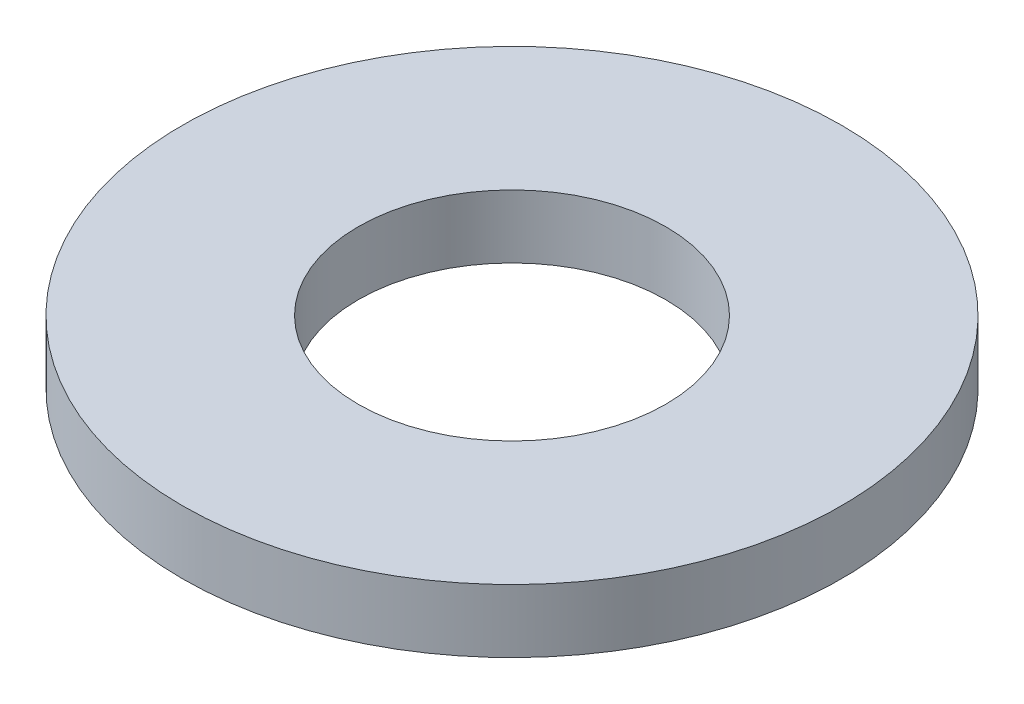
ISO-10303-21;
HEADER;
FILE_DESCRIPTION(('STEP AP214'),'2;1');
FILE_NAME('part.step','',(''),(''),'','','');
FILE_SCHEMA(('AUTOMOTIVE_DESIGN { 1 0 10303 214 1 1 1 1 }'));
ENDSEC;
DATA;
#1=APPLICATION_CONTEXT('core data for automotive mechanical design processes');
#2=APPLICATION_PROTOCOL_DEFINITION('international standard','automotive_design',2000,#1);
#3=PRODUCT_CONTEXT('',#1,'mechanical');
#4=PRODUCT('Part','Part','',(#3));
#5=PRODUCT_RELATED_PRODUCT_CATEGORY('part','',(#4));
#6=PRODUCT_DEFINITION_FORMATION('','',#4);
#7=PRODUCT_DEFINITION_CONTEXT('part definition',#1,'design');
#8=PRODUCT_DEFINITION('design','',#6,#7);
#9=PRODUCT_DEFINITION_SHAPE('','',#8);
#10=(LENGTH_UNIT() NAMED_UNIT(*) SI_UNIT(.MILLI.,.METRE.));
#11=(NAMED_UNIT(*) PLANE_ANGLE_UNIT() SI_UNIT($,.RADIAN.));
#12=(NAMED_UNIT(*) SI_UNIT($,.STERADIAN.) SOLID_ANGLE_UNIT());
#13=UNCERTAINTY_MEASURE_WITH_UNIT(LENGTH_MEASURE(1.E-05),#10,'distance_accuracy_value','');
#14=(GEOMETRIC_REPRESENTATION_CONTEXT(3) GLOBAL_UNCERTAINTY_ASSIGNED_CONTEXT((#13)) GLOBAL_UNIT_ASSIGNED_CONTEXT((#10,
#11,#12)) REPRESENTATION_CONTEXT('',''));
#15=CARTESIAN_POINT('',(0.,0.,0.));
#16=DIRECTION('',(0.,0.,1.));
#17=DIRECTION('',(1.,0.,0.));
#18=AXIS2_PLACEMENT_3D('',#15,#16,#17);
#19=CARTESIAN_POINT('',(0.,0.9144,0.));
#20=DIRECTION('',(0.,-1.,0.));
#21=DIRECTION('',(0.,0.,-1.));
#22=AXIS2_PLACEMENT_3D('',#19,#20,#21);
#23=CYLINDRICAL_SURFACE('',#22,4.7625);
#24=CARTESIAN_POINT('',(0.,0.9144,0.));
#25=DIRECTION('',(0.,1.,0.));
#26=DIRECTION('',(0.,0.,1.));
#27=AXIS2_PLACEMENT_3D('',#24,#25,#26);
#28=CIRCLE('',#27,4.7625);
#29=CARTESIAN_POINT('',(0.,0.9144,4.7625));
#30=VERTEX_POINT('',#29);
#31=EDGE_CURVE('E10',#30,#30,#28,.T.);
#32=ORIENTED_EDGE('',*,*,#31,.F.);
#33=EDGE_LOOP('',(#32));
#34=FACE_BOUND('',#33,.T.);
#35=CARTESIAN_POINT('',(0.,0.,0.));
#36=DIRECTION('',(0.,1.,0.));
#37=DIRECTION('',(0.,0.,1.));
#38=AXIS2_PLACEMENT_3D('',#35,#36,#37);
#39=CIRCLE('',#38,4.7625);
#40=CARTESIAN_POINT('',(0.,0.,4.7625));
#41=VERTEX_POINT('',#40);
#42=EDGE_CURVE('E35',#41,#41,#39,.T.);
#43=ORIENTED_EDGE('',*,*,#42,.T.);
#44=EDGE_LOOP('',(#43));
#45=FACE_BOUND('',#44,.T.);
#46=ADVANCED_FACE('F32',(#34,#45),#23,.T.);
#47=CARTESIAN_POINT('',(0.,0.9144,0.));
#48=DIRECTION('',(0.,1.,0.));
#49=DIRECTION('',(0.,0.,1.));
#50=AXIS2_PLACEMENT_3D('',#47,#48,#49);
#51=PLANE('',#50);
#52=CARTESIAN_POINT('',(0.,0.9144,0.));
#53=DIRECTION('',(0.,1.,0.));
#54=DIRECTION('',(0.,0.,1.));
#55=AXIS2_PLACEMENT_3D('',#52,#53,#54);
#56=CIRCLE('',#55,2.2225);
#57=CARTESIAN_POINT('',(0.,0.9144,2.2225));
#58=VERTEX_POINT('',#57);
#59=EDGE_CURVE('E44',#58,#58,#56,.T.);
#60=ORIENTED_EDGE('',*,*,#59,.F.);
#61=EDGE_LOOP('',(#60));
#62=FACE_BOUND('',#61,.T.);
#63=ORIENTED_EDGE('',*,*,#31,.T.);
#64=EDGE_LOOP('',(#63));
#65=FACE_BOUND('',#64,.T.);
#66=ADVANCED_FACE('F59',(#62,#65),#51,.T.);
#67=CARTESIAN_POINT('',(0.,0.,0.));
#68=DIRECTION('',(0.,1.,0.));
#69=DIRECTION('',(0.,0.,1.));
#70=AXIS2_PLACEMENT_3D('',#67,#68,#69);
#71=PLANE('',#70);
#72=CARTESIAN_POINT('',(0.,0.,0.));
#73=DIRECTION('',(0.,1.,0.));
#74=DIRECTION('',(0.,0.,1.));
#75=AXIS2_PLACEMENT_3D('',#72,#73,#74);
#76=CIRCLE('',#75,2.2225);
#77=CARTESIAN_POINT('',(0.,0.,2.2225));
#78=VERTEX_POINT('',#77);
#79=EDGE_CURVE('E42',#78,#78,#76,.T.);
#80=ORIENTED_EDGE('',*,*,#79,.T.);
#81=EDGE_LOOP('',(#80));
#82=FACE_BOUND('',#81,.T.);
#83=ORIENTED_EDGE('',*,*,#42,.F.);
#84=EDGE_LOOP('',(#83));
#85=FACE_BOUND('',#84,.T.);
#86=ADVANCED_FACE('F50',(#82,#85),#71,.F.);
#87=CARTESIAN_POINT('',(0.,0.,0.));
#88=DIRECTION('',(0.,1.,0.));
#89=DIRECTION('',(0.,0.,1.));
#90=AXIS2_PLACEMENT_3D('',#87,#88,#89);
#91=CYLINDRICAL_SURFACE('',#90,2.2225);
#92=ORIENTED_EDGE('',*,*,#79,.F.);
#93=EDGE_LOOP('',(#92));
#94=FACE_BOUND('',#93,.T.);
#95=ORIENTED_EDGE('',*,*,#59,.T.);
#96=EDGE_LOOP('',(#95));
#97=FACE_BOUND('',#96,.T.);
#98=ADVANCED_FACE('F53',(#94,#97),#91,.F.);
#99=CLOSED_SHELL('',(#46,#66,#86,#98));
#100=MANIFOLD_SOLID_BREP('B2',#99);
#101=ADVANCED_BREP_SHAPE_REPRESENTATION('',(#18,#100),#14);
#102=SHAPE_DEFINITION_REPRESENTATION(#9,#101);
ENDSEC;
END-ISO-10303-21;
